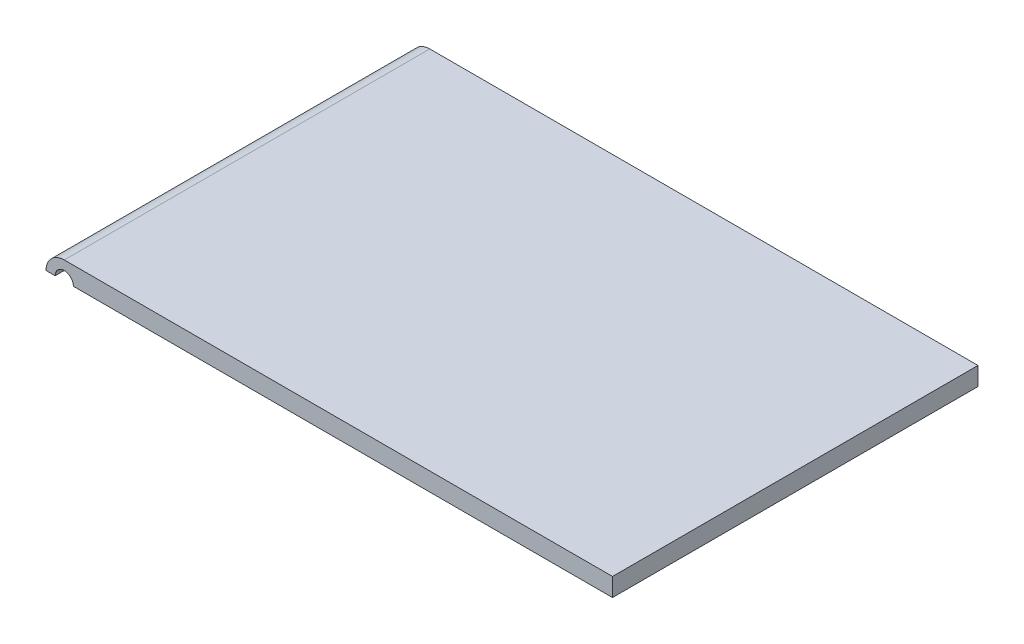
ISO-10303-21;
HEADER;
FILE_DESCRIPTION(('STEP AP214'),'2;1');
FILE_NAME('part.step','',(''),(''),'','','');
FILE_SCHEMA(('AUTOMOTIVE_DESIGN { 1 0 10303 214 1 1 1 1 }'));
ENDSEC;
DATA;
#1=APPLICATION_CONTEXT('core data for automotive mechanical design processes');
#2=APPLICATION_PROTOCOL_DEFINITION('international standard','automotive_design',2000,#1);
#3=PRODUCT_CONTEXT('',#1,'mechanical');
#4=PRODUCT('Part','Part','',(#3));
#5=PRODUCT_RELATED_PRODUCT_CATEGORY('part','',(#4));
#6=PRODUCT_DEFINITION_FORMATION('','',#4);
#7=PRODUCT_DEFINITION_CONTEXT('part definition',#1,'design');
#8=PRODUCT_DEFINITION('design','',#6,#7);
#9=PRODUCT_DEFINITION_SHAPE('','',#8);
#10=(LENGTH_UNIT() NAMED_UNIT(*) SI_UNIT(.MILLI.,.METRE.));
#11=(NAMED_UNIT(*) PLANE_ANGLE_UNIT() SI_UNIT($,.RADIAN.));
#12=(NAMED_UNIT(*) SI_UNIT($,.STERADIAN.) SOLID_ANGLE_UNIT());
#13=UNCERTAINTY_MEASURE_WITH_UNIT(LENGTH_MEASURE(1.E-05),#10,'distance_accuracy_value','');
#14=(GEOMETRIC_REPRESENTATION_CONTEXT(3) GLOBAL_UNCERTAINTY_ASSIGNED_CONTEXT((#13)) GLOBAL_UNIT_ASSIGNED_CONTEXT((#10,
#11,#12)) REPRESENTATION_CONTEXT('',''));
#15=CARTESIAN_POINT('',(0.,0.,0.));
#16=DIRECTION('',(0.,0.,1.));
#17=DIRECTION('',(1.,0.,0.));
#18=AXIS2_PLACEMENT_3D('',#15,#16,#17);
#19=CARTESIAN_POINT('',(0.,-5.,50.));
#20=DIRECTION('',(0.,1.,0.));
#21=DIRECTION('',(0.,0.,1.));
#22=AXIS2_PLACEMENT_3D('',#19,#20,#21);
#23=PLANE('',#22);
#24=DIRECTION('',(1.,0.,0.));
#25=VECTOR('',#24,1.);
#26=CARTESIAN_POINT('',(0.,-5.,-50.));
#27=LINE('',#26,#25);
#28=CARTESIAN_POINT('',(-5.,-5.,-50.));
#29=VERTEX_POINT('',#28);
#30=CARTESIAN_POINT('',(-2.5,-5.,-50.));
#31=VERTEX_POINT('',#30);
#32=EDGE_CURVE('E109',#29,#31,#27,.T.);
#33=ORIENTED_EDGE('',*,*,#32,.T.);
#34=DIRECTION('',(0.,0.,1.));
#35=VECTOR('',#34,1.);
#36=CARTESIAN_POINT('',(-2.5,-5.,-50.));
#37=LINE('',#36,#35);
#38=CARTESIAN_POINT('',(-2.5,-5.,50.));
#39=VERTEX_POINT('',#38);
#40=EDGE_CURVE('E50',#31,#39,#37,.T.);
#41=ORIENTED_EDGE('',*,*,#40,.T.);
#42=DIRECTION('',(1.,0.,0.));
#43=VECTOR('',#42,1.);
#44=CARTESIAN_POINT('',(0.,-5.,50.));
#45=LINE('',#44,#43);
#46=CARTESIAN_POINT('',(-5.,-5.,50.));
#47=VERTEX_POINT('',#46);
#48=EDGE_CURVE('E138',#47,#39,#45,.T.);
#49=ORIENTED_EDGE('',*,*,#48,.F.);
#50=DIRECTION('',(0.,0.,1.));
#51=VECTOR('',#50,1.);
#52=CARTESIAN_POINT('',(-5.,-5.,-57.0710678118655));
#53=LINE('',#52,#51);
#54=EDGE_CURVE('E113',#29,#47,#53,.T.);
#55=ORIENTED_EDGE('',*,*,#54,.F.);
#56=EDGE_LOOP('',(#33,#41,#49,#55));
#57=FACE_BOUND('',#56,.T.);
#58=ADVANCED_FACE('F35',(#57),#23,.F.);
#59=CARTESIAN_POINT('',(2.5,-5.,50.));
#60=VERTEX_POINT('',#59);
#61=CARTESIAN_POINT('',(150.,-5.,50.));
#62=VERTEX_POINT('',#61);
#63=EDGE_CURVE('E78',#60,#62,#45,.T.);
#64=ORIENTED_EDGE('',*,*,#63,.F.);
#65=DIRECTION('',(0.,0.,1.));
#66=VECTOR('',#65,1.);
#67=CARTESIAN_POINT('',(2.5,-5.,-50.));
#68=LINE('',#67,#66);
#69=CARTESIAN_POINT('',(2.5,-5.,-50.));
#70=VERTEX_POINT('',#69);
#71=EDGE_CURVE('E98',#60,#70,#68,.F.);
#72=ORIENTED_EDGE('',*,*,#71,.T.);
#73=CARTESIAN_POINT('',(150.,-5.,-50.));
#74=VERTEX_POINT('',#73);
#75=EDGE_CURVE('E105',#70,#74,#27,.T.);
#76=ORIENTED_EDGE('',*,*,#75,.T.);
#77=DIRECTION('',(0.,0.,-1.));
#78=VECTOR('',#77,1.);
#79=CARTESIAN_POINT('',(150.,-5.,50.));
#80=LINE('',#79,#78);
#81=EDGE_CURVE('E11',#62,#74,#80,.T.);
#82=ORIENTED_EDGE('',*,*,#81,.F.);
#83=EDGE_LOOP('',(#64,#72,#76,#82));
#84=FACE_BOUND('',#83,.T.);
#85=ADVANCED_FACE('F37',(#84),#23,.F.);
#86=CARTESIAN_POINT('',(150.,0.,50.));
#87=DIRECTION('',(-1.,0.,0.));
#88=DIRECTION('',(0.,0.,1.));
#89=AXIS2_PLACEMENT_3D('',#86,#87,#88);
#90=PLANE('',#89);
#91=DIRECTION('',(0.,1.,0.));
#92=VECTOR('',#91,1.);
#93=CARTESIAN_POINT('',(150.,0.,-50.));
#94=LINE('',#93,#92);
#95=CARTESIAN_POINT('',(150.,0.,-50.));
#96=VERTEX_POINT('',#95);
#97=EDGE_CURVE('E73',#74,#96,#94,.T.);
#98=ORIENTED_EDGE('',*,*,#97,.T.);
#99=DIRECTION('',(0.,0.,-1.));
#100=VECTOR('',#99,1.);
#101=CARTESIAN_POINT('',(150.,0.,50.));
#102=LINE('',#101,#100);
#103=CARTESIAN_POINT('',(150.,0.,50.));
#104=VERTEX_POINT('',#103);
#105=EDGE_CURVE('E43',#104,#96,#102,.T.);
#106=ORIENTED_EDGE('',*,*,#105,.F.);
#107=DIRECTION('',(0.,1.,0.));
#108=VECTOR('',#107,1.);
#109=CARTESIAN_POINT('',(150.,0.,50.));
#110=LINE('',#109,#108);
#111=EDGE_CURVE('E139',#62,#104,#110,.T.);
#112=ORIENTED_EDGE('',*,*,#111,.F.);
#113=ORIENTED_EDGE('',*,*,#81,.T.);
#114=EDGE_LOOP('',(#98,#106,#112,#113));
#115=FACE_BOUND('',#114,.T.);
#116=ADVANCED_FACE('F141',(#115),#90,.F.);
#117=CARTESIAN_POINT('',(0.,0.,50.));
#118=DIRECTION('',(0.,-1.,0.));
#119=DIRECTION('',(0.,0.,-1.));
#120=AXIS2_PLACEMENT_3D('',#117,#118,#119);
#121=PLANE('',#120);
#122=DIRECTION('',(-1.,0.,0.));
#123=VECTOR('',#122,1.);
#124=CARTESIAN_POINT('',(0.,0.,-50.));
#125=LINE('',#124,#123);
#126=CARTESIAN_POINT('',(0.,0.,-50.));
#127=VERTEX_POINT('',#126);
#128=EDGE_CURVE('E119',#96,#127,#125,.T.);
#129=ORIENTED_EDGE('',*,*,#128,.T.);
#130=DIRECTION('',(0.,0.,-1.));
#131=VECTOR('',#130,1.);
#132=CARTESIAN_POINT('',(0.,0.,50.));
#133=LINE('',#132,#131);
#134=CARTESIAN_POINT('',(0.,0.,50.));
#135=VERTEX_POINT('',#134);
#136=EDGE_CURVE('E121',#135,#127,#133,.T.);
#137=ORIENTED_EDGE('',*,*,#136,.F.);
#138=DIRECTION('',(-1.,0.,0.));
#139=VECTOR('',#138,1.);
#140=CARTESIAN_POINT('',(0.,0.,50.));
#141=LINE('',#140,#139);
#142=EDGE_CURVE('E59',#104,#135,#141,.T.);
#143=ORIENTED_EDGE('',*,*,#142,.F.);
#144=ORIENTED_EDGE('',*,*,#105,.T.);
#145=EDGE_LOOP('',(#129,#137,#143,#144));
#146=FACE_BOUND('',#145,.T.);
#147=ADVANCED_FACE('F124',(#146),#121,.F.);
#148=CARTESIAN_POINT('',(0.,-5.,50.));
#149=DIRECTION('',(0.,0.,1.));
#150=DIRECTION('',(1.,0.,0.));
#151=AXIS2_PLACEMENT_3D('',#148,#149,#150);
#152=PLANE('',#151);
#153=CARTESIAN_POINT('',(0.,-5.,50.));
#154=DIRECTION('',(0.,0.,1.));
#155=DIRECTION('',(1.,0.,0.));
#156=AXIS2_PLACEMENT_3D('',#153,#154,#155);
#157=CIRCLE('',#156,2.5);
#158=EDGE_CURVE('E102',#60,#39,#157,.T.);
#159=ORIENTED_EDGE('',*,*,#158,.F.);
#160=ORIENTED_EDGE('',*,*,#63,.T.);
#161=ORIENTED_EDGE('',*,*,#111,.T.);
#162=ORIENTED_EDGE('',*,*,#142,.T.);
#163=CARTESIAN_POINT('',(0.,-5.,50.));
#164=DIRECTION('',(0.,0.,1.));
#165=DIRECTION('',(1.,0.,0.));
#166=AXIS2_PLACEMENT_3D('',#163,#164,#165);
#167=CIRCLE('',#166,5.);
#168=EDGE_CURVE('E132',#135,#47,#167,.T.);
#169=ORIENTED_EDGE('',*,*,#168,.T.);
#170=ORIENTED_EDGE('',*,*,#48,.T.);
#171=EDGE_LOOP('',(#159,#160,#161,#162,#169,#170));
#172=FACE_BOUND('',#171,.T.);
#173=ADVANCED_FACE('F140',(#172),#152,.T.);
#174=CARTESIAN_POINT('',(0.,-5.,-50.));
#175=DIRECTION('',(0.,0.,1.));
#176=DIRECTION('',(1.,0.,0.));
#177=AXIS2_PLACEMENT_3D('',#174,#175,#176);
#178=PLANE('',#177);
#179=ORIENTED_EDGE('',*,*,#75,.F.);
#180=CARTESIAN_POINT('',(0.,-5.,-50.));
#181=DIRECTION('',(0.,0.,1.));
#182=DIRECTION('',(1.,0.,0.));
#183=AXIS2_PLACEMENT_3D('',#180,#181,#182);
#184=CIRCLE('',#183,2.5);
#185=EDGE_CURVE('E95',#70,#31,#184,.T.);
#186=ORIENTED_EDGE('',*,*,#185,.T.);
#187=ORIENTED_EDGE('',*,*,#32,.F.);
#188=CARTESIAN_POINT('',(0.,-5.,-50.));
#189=DIRECTION('',(0.,0.,1.));
#190=DIRECTION('',(1.,0.,0.));
#191=AXIS2_PLACEMENT_3D('',#188,#189,#190);
#192=CIRCLE('',#191,5.);
#193=EDGE_CURVE('E110',#29,#127,#192,.F.);
#194=ORIENTED_EDGE('',*,*,#193,.T.);
#195=ORIENTED_EDGE('',*,*,#128,.F.);
#196=ORIENTED_EDGE('',*,*,#97,.F.);
#197=EDGE_LOOP('',(#179,#186,#187,#194,#195,#196));
#198=FACE_BOUND('',#197,.T.);
#199=ADVANCED_FACE('F107',(#198),#178,.F.);
#200=CARTESIAN_POINT('',(0.,-5.,-57.0710678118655));
#201=DIRECTION('',(0.,0.,1.));
#202=DIRECTION('',(1.,0.,0.));
#203=AXIS2_PLACEMENT_3D('',#200,#201,#202);
#204=CYLINDRICAL_SURFACE('',#203,5.);
#205=ORIENTED_EDGE('',*,*,#193,.F.);
#206=ORIENTED_EDGE('',*,*,#54,.T.);
#207=ORIENTED_EDGE('',*,*,#168,.F.);
#208=ORIENTED_EDGE('',*,*,#136,.T.);
#209=EDGE_LOOP('',(#205,#206,#207,#208));
#210=FACE_BOUND('',#209,.T.);
#211=ADVANCED_FACE('F131',(#210),#204,.T.);
#212=CARTESIAN_POINT('',(0.,-5.,-50.));
#213=DIRECTION('',(0.,0.,1.));
#214=DIRECTION('',(1.,0.,0.));
#215=AXIS2_PLACEMENT_3D('',#212,#213,#214);
#216=CYLINDRICAL_SURFACE('',#215,2.5);
#217=ORIENTED_EDGE('',*,*,#185,.F.);
#218=ORIENTED_EDGE('',*,*,#71,.F.);
#219=ORIENTED_EDGE('',*,*,#158,.T.);
#220=ORIENTED_EDGE('',*,*,#40,.F.);
#221=EDGE_LOOP('',(#217,#218,#219,#220));
#222=FACE_BOUND('',#221,.T.);
#223=ADVANCED_FACE('F97',(#222),#216,.F.);
#224=CLOSED_SHELL('',(#58,#85,#116,#147,#173,#199,#211,#223));
#225=MANIFOLD_SOLID_BREP('B2',#224);
#226=ADVANCED_BREP_SHAPE_REPRESENTATION('',(#18,#225),#14);
#227=SHAPE_DEFINITION_REPRESENTATION(#9,#226);
ENDSEC;
END-ISO-10303-21;
